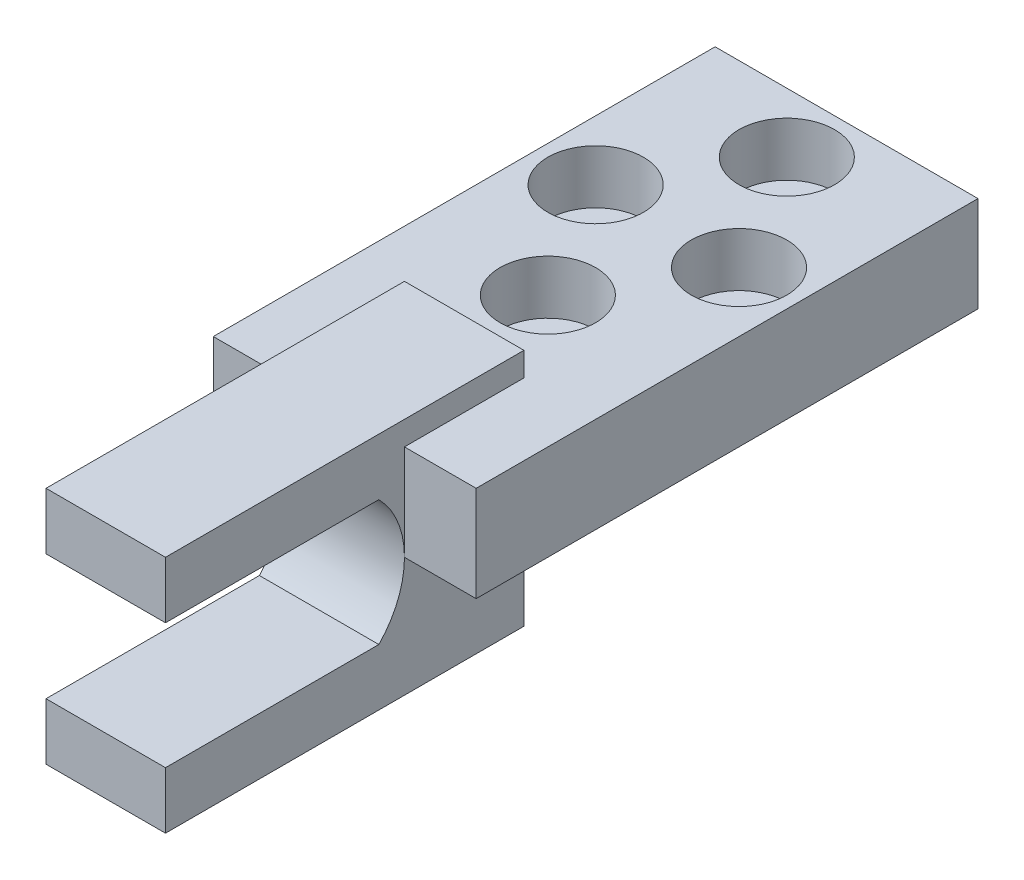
from build123d import *

# Parameters (mm, degrees)
EXTRUDE_1_DEPTH     = 62
SKETCH_2_OUTSIDE_W  = 77.752
SKETCH_2_OUTSIDE_H  = 35.752
CUT_EXTRUDE_1_DEPTH = 62
SKETCH_3_R          = 2.25
CUT_EXTRUDE_2_DEPTH = 62
SKETCH_4_R          = 4
CUT_EXTRUDE_3_DEPTH = 4.5
SKETCH_5_W          = 6.873976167
SKETCH_5_H          = 21.21014838
SKETCH_5_W_2        = 8.27091454
CUT_EXTRUDE_4_DEPTH = 69.760453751


with BuildPart() as part:
    # Sketch 1 → Extrude 1 (new body)
    with BuildSketch(Plane.XY):
        Polygon((6, 0), (6, 10), (0, 10), (0, 18), (6, 18), (6, 20), (16, 20), (16, 18), (22, 18), (22, 10), (16, 10), (16, 0), align=None)
    extrude(amount=EXTRUDE_1_DEPTH)

    # Sketch 2 outside → Cut-Extrude 1 (cut)
    with BuildSketch(Plane(origin=(22, 0, 0), x_dir=(0, 0, -1), z_dir=(1, 0, 0))):
        with Locations((-31, 10)):
            Rectangle(SKETCH_2_OUTSIDE_W, SKETCH_2_OUTSIDE_H)
        with BuildLine():
            Line((0, 10), (0, 18))
            Line((0, 18), (-32, 18))
            Line((-32, 18), (-32, 20))
            Line((-32, 20), (-62, 20))
            Line((-62, 20), (-62, 15.25))
            Line((-62, 15.25), (-44.143928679, 15.25))
            ThreePointArc((-44.143928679, 15.25), (-42, 10), (-44.143928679, 4.75))
            Line((-44.143928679, 4.75), (-62, 4.75))
            Line((-62, 4.75), (-62, 0))
            Line((-62, 0), (-32, 0))
            Line((-32, 0), (-32, 10))
            Line((-32, 10), (0, 10))
        make_face(mode=Mode.SUBTRACT)
    extrude(amount=-CUT_EXTRUDE_1_DEPTH, mode=Mode.SUBTRACT)

    # Sketch 3 → Cut-Extrude 2 (cut)
    with BuildSketch(Plane(origin=(0, 18, 0), x_dir=(1, 0, 0), z_dir=(0, 1, 0))):
        with Locations(Location((11, -5, 0), (0, 0, 180))):
            Circle(SKETCH_3_R)
        with Locations(Location((11, -25, 0), (0, 0, 180))):
            Circle(SKETCH_3_R)
        with Locations(Location((5, -15, 0), (0, 0, 180))):
            Circle(SKETCH_3_R)
        with Locations(Location((17, -15, 0), (0, 0, 180))):
            Circle(SKETCH_3_R)
    extrude(amount=-CUT_EXTRUDE_2_DEPTH, mode=Mode.SUBTRACT)

    # Sketch 4 → Cut-Extrude 3 (cut)
    with BuildSketch(Plane(origin=(0, 18, 0), x_dir=(1, 0, 0), z_dir=(0, 1, 0))):
        with Locations(Location((11, -5, 0), (0, 0, 180))):
            Circle(SKETCH_4_R)
        with Locations(Location((11, -25, 0), (0, 0, 180))):
            Circle(SKETCH_4_R)
        with Locations(Location((5, -15, 0), (0, 0, 180))):
            Circle(SKETCH_4_R)
        with Locations(Location((17, -15, 0), (0, 0, 180))):
            Circle(SKETCH_4_R)
    extrude(amount=-CUT_EXTRUDE_3_DEPTH, mode=Mode.SUBTRACT)

    # Sketch 5 → Cut-Extrude 4 (cut, through all)
    with BuildSketch(Plane.XZ):
        with Locations((2.563011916, 52.60507419)):
            Rectangle(SKETCH_5_W, SKETCH_5_H)
        with Locations((20.13545727, 52.60507419)):
            Rectangle(SKETCH_5_W_2, SKETCH_5_H)
    extrude(amount=-CUT_EXTRUDE_4_DEPTH, mode=Mode.SUBTRACT)


solid = part.part
